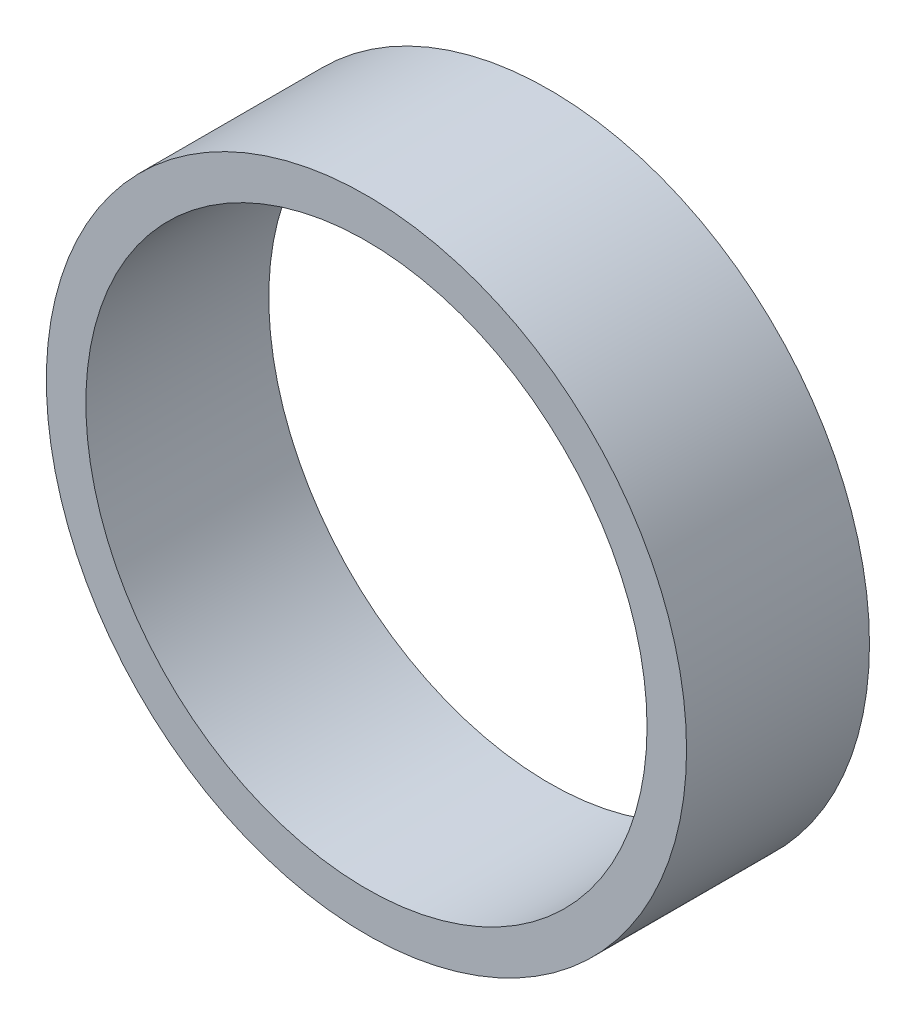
ISO-10303-21;
HEADER;
FILE_DESCRIPTION(('STEP AP214'),'2;1');
FILE_NAME('part.step','',(''),(''),'','','');
FILE_SCHEMA(('AUTOMOTIVE_DESIGN { 1 0 10303 214 1 1 1 1 }'));
ENDSEC;
DATA;
#1=APPLICATION_CONTEXT('core data for automotive mechanical design processes');
#2=APPLICATION_PROTOCOL_DEFINITION('international standard','automotive_design',2000,#1);
#3=PRODUCT_CONTEXT('',#1,'mechanical');
#4=PRODUCT('Part','Part','',(#3));
#5=PRODUCT_RELATED_PRODUCT_CATEGORY('part','',(#4));
#6=PRODUCT_DEFINITION_FORMATION('','',#4);
#7=PRODUCT_DEFINITION_CONTEXT('part definition',#1,'design');
#8=PRODUCT_DEFINITION('design','',#6,#7);
#9=PRODUCT_DEFINITION_SHAPE('','',#8);
#10=(LENGTH_UNIT() NAMED_UNIT(*) SI_UNIT(.MILLI.,.METRE.));
#11=(NAMED_UNIT(*) PLANE_ANGLE_UNIT() SI_UNIT($,.RADIAN.));
#12=(NAMED_UNIT(*) SI_UNIT($,.STERADIAN.) SOLID_ANGLE_UNIT());
#13=UNCERTAINTY_MEASURE_WITH_UNIT(LENGTH_MEASURE(1.E-05),#10,'distance_accuracy_value','');
#14=(GEOMETRIC_REPRESENTATION_CONTEXT(3) GLOBAL_UNCERTAINTY_ASSIGNED_CONTEXT((#13)) GLOBAL_UNIT_ASSIGNED_CONTEXT((#10,
#11,#12)) REPRESENTATION_CONTEXT('',''));
#15=CARTESIAN_POINT('',(0.,0.,0.));
#16=DIRECTION('',(0.,0.,1.));
#17=DIRECTION('',(1.,0.,0.));
#18=AXIS2_PLACEMENT_3D('',#15,#16,#17);
#19=CARTESIAN_POINT('',(0.,0.,12.7));
#20=DIRECTION('',(0.,0.,1.));
#21=DIRECTION('',(1.,0.,0.));
#22=AXIS2_PLACEMENT_3D('',#19,#20,#21);
#23=PLANE('',#22);
#24=CARTESIAN_POINT('',(0.,0.,12.7));
#25=DIRECTION('',(0.,0.,1.));
#26=DIRECTION('',(1.,0.,0.));
#27=AXIS2_PLACEMENT_3D('',#24,#25,#26);
#28=CIRCLE('',#27,44.4499615);
#29=CARTESIAN_POINT('',(44.4499615,0.,12.7));
#30=VERTEX_POINT('',#29);
#31=EDGE_CURVE('E10',#30,#30,#28,.T.);
#32=ORIENTED_EDGE('',*,*,#31,.T.);
#33=EDGE_LOOP('',(#32));
#34=FACE_BOUND('',#33,.T.);
#35=CARTESIAN_POINT('',(0.,0.,12.7));
#36=DIRECTION('',(0.,0.,1.));
#37=DIRECTION('',(1.,0.,0.));
#38=AXIS2_PLACEMENT_3D('',#35,#36,#37);
#39=CIRCLE('',#38,38.963566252);
#40=CARTESIAN_POINT('',(38.963566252,0.,12.7));
#41=VERTEX_POINT('',#40);
#42=EDGE_CURVE('E42',#41,#41,#39,.T.);
#43=ORIENTED_EDGE('',*,*,#42,.F.);
#44=EDGE_LOOP('',(#43));
#45=FACE_BOUND('',#44,.T.);
#46=ADVANCED_FACE('F31',(#34,#45),#23,.T.);
#47=CARTESIAN_POINT('',(0.,0.,-12.7));
#48=DIRECTION('',(0.,0.,1.));
#49=DIRECTION('',(1.,0.,0.));
#50=AXIS2_PLACEMENT_3D('',#47,#48,#49);
#51=PLANE('',#50);
#52=CARTESIAN_POINT('',(0.,0.,-12.7));
#53=DIRECTION('',(0.,0.,1.));
#54=DIRECTION('',(1.,0.,0.));
#55=AXIS2_PLACEMENT_3D('',#52,#53,#54);
#56=CIRCLE('',#55,44.4499615);
#57=CARTESIAN_POINT('',(44.4499615,0.,-12.7));
#58=VERTEX_POINT('',#57);
#59=EDGE_CURVE('E35',#58,#58,#56,.T.);
#60=ORIENTED_EDGE('',*,*,#59,.F.);
#61=EDGE_LOOP('',(#60));
#62=FACE_BOUND('',#61,.T.);
#63=CARTESIAN_POINT('',(0.,0.,-12.7));
#64=DIRECTION('',(0.,0.,1.));
#65=DIRECTION('',(1.,0.,0.));
#66=AXIS2_PLACEMENT_3D('',#63,#64,#65);
#67=CIRCLE('',#66,38.963566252);
#68=CARTESIAN_POINT('',(38.963566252,0.,-12.7));
#69=VERTEX_POINT('',#68);
#70=EDGE_CURVE('E44',#69,#69,#67,.T.);
#71=ORIENTED_EDGE('',*,*,#70,.T.);
#72=EDGE_LOOP('',(#71));
#73=FACE_BOUND('',#72,.T.);
#74=ADVANCED_FACE('F54',(#62,#73),#51,.F.);
#75=CARTESIAN_POINT('',(0.,0.,12.7));
#76=DIRECTION('',(0.,0.,-1.));
#77=DIRECTION('',(-1.,0.,0.));
#78=AXIS2_PLACEMENT_3D('',#75,#76,#77);
#79=CYLINDRICAL_SURFACE('',#78,44.4499615);
#80=ORIENTED_EDGE('',*,*,#31,.F.);
#81=EDGE_LOOP('',(#80));
#82=FACE_BOUND('',#81,.T.);
#83=ORIENTED_EDGE('',*,*,#59,.T.);
#84=EDGE_LOOP('',(#83));
#85=FACE_BOUND('',#84,.T.);
#86=ADVANCED_FACE('F33',(#82,#85),#79,.T.);
#87=CARTESIAN_POINT('',(0.,0.,12.7));
#88=DIRECTION('',(0.,0.,-1.));
#89=DIRECTION('',(-1.,0.,0.));
#90=AXIS2_PLACEMENT_3D('',#87,#88,#89);
#91=CYLINDRICAL_SURFACE('',#90,38.963566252);
#92=ORIENTED_EDGE('',*,*,#42,.T.);
#93=EDGE_LOOP('',(#92));
#94=FACE_BOUND('',#93,.T.);
#95=ORIENTED_EDGE('',*,*,#70,.F.);
#96=EDGE_LOOP('',(#95));
#97=FACE_BOUND('',#96,.T.);
#98=ADVANCED_FACE('F50',(#94,#97),#91,.F.);
#99=CLOSED_SHELL('',(#46,#74,#86,#98));
#100=MANIFOLD_SOLID_BREP('B2',#99);
#101=ADVANCED_BREP_SHAPE_REPRESENTATION('',(#18,#100),#14);
#102=SHAPE_DEFINITION_REPRESENTATION(#9,#101);
ENDSEC;
END-ISO-10303-21;
